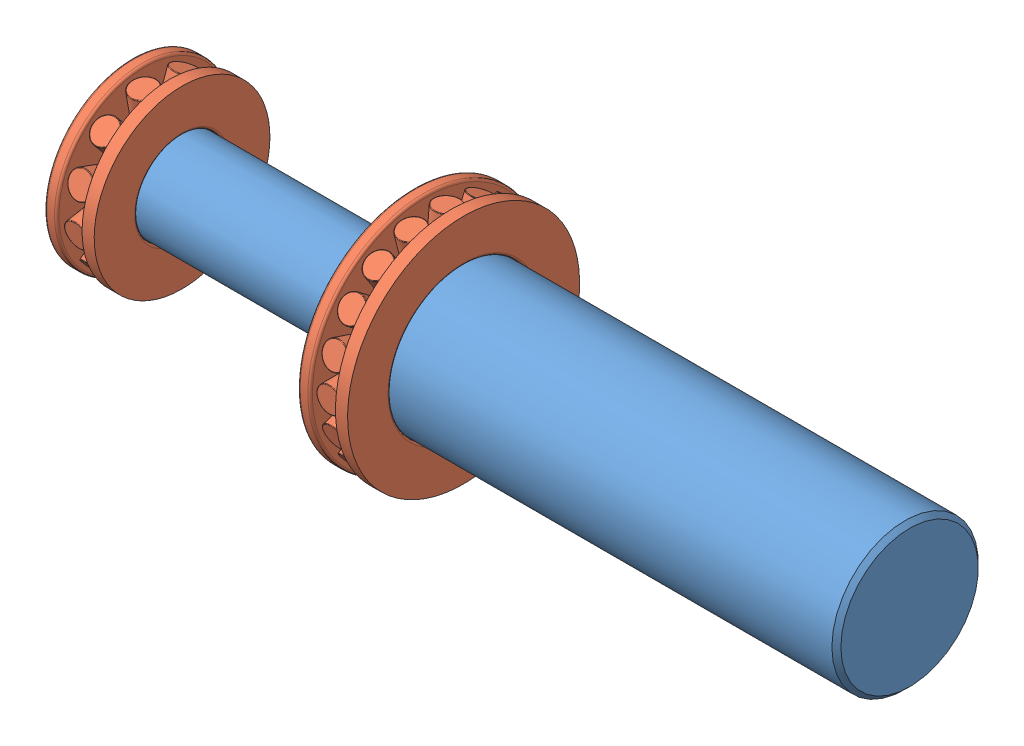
SolidWorks assembly shaft_assembly.sldasm, configuration Default (file format 3042). Lengths in mm.
Overall size (350 119.11 119.11).
3 component instances, 2 part files, 4 mates.
Components (placement in the parent):
- shaft2-1: shaft2.SLDPRT [Default] at (-76.1954 18.5223 -17.2299) size (350 65 65)
- bearing-1: bearing.SLDPRT [40 bore] at (-60.1954 18.5223 -17.2299) x (-1 0 0) z (0 -0.985252 -0.171108) size (22 78 78)
- bearing-2: bearing.SLDPRT [65 bore] at (64.8046 18.5223 -17.2299) x (-1 0 0) z (0 -0.985252 -0.171108) size (22 103 103)
Mates (geometry in assembly coordinates):
- Concentric11: concentric aligned: cylinder of shaft2-1; cylinder of bearing-1
- Concentric22: concentric aligned: cylinder of shaft2-1; cylinder of bearing-2
- Distance1: distance = 5 mm aligned: plane of shaft2-1 through (48.8046 38.5223 -17.2299) normal (-1 0 0); plane of bearing-2
- Distance2: distance = 5 mm aligned: plane of shaft2-1 through (-76.1954 18.5223 -17.2299) normal (-1 0 0); plane of bearing-1
